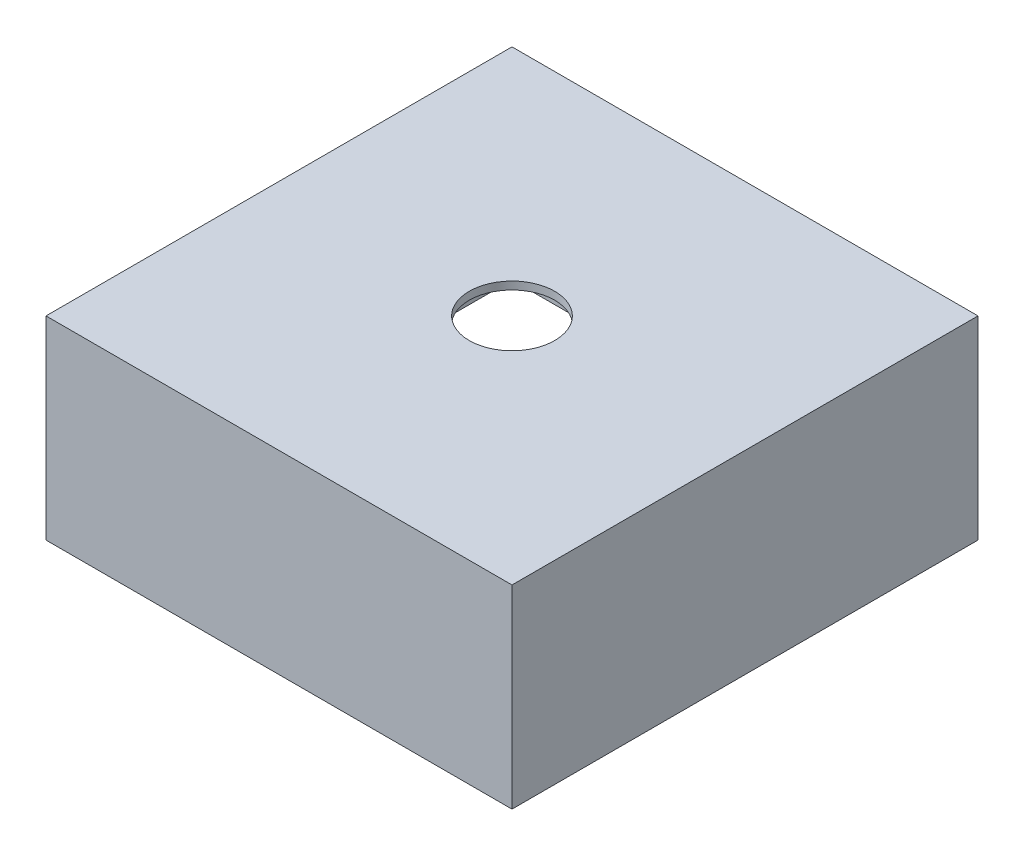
from build123d import *

# Parameters (mm, degrees)
SKETCH1_W           = 152.4
SKETCH1_H           = 152.4
BOSS_EXTRUDE1_DEPTH = 63.5
SHELL1_T            = -2.54
SKETCH2_R           = 13.97
CUT_EXTRUDE1_DEPTH  = 2.54


with BuildPart() as part:
    # Sketch1 → Boss-Extrude1 (new body)
    with BuildSketch(Plane(origin=(0, 0, 0), x_dir=(1, 0, 0), z_dir=(0, 1, 0))):
        Rectangle(SKETCH1_W, SKETCH1_H)
    extrude(amount=BOSS_EXTRUDE1_DEPTH)

    # Shell1
    shell1_openings = [part.faces().sort_by_distance(p)[0] for p in [
        (0, 0, 0),
    ]]
    offset(amount=SHELL1_T, openings=shell1_openings, kind=Kind.INTERSECTION)

    # Sketch2 → Cut-Extrude1 (cut)
    with BuildSketch(Plane(origin=(0, 63.5, 0), x_dir=(1, 0, 0), z_dir=(0, 1, 0))):
        with Locations(Location((0, 0, 0), (0, 0, 270))):
            Circle(SKETCH2_R)
    extrude(amount=-CUT_EXTRUDE1_DEPTH, mode=Mode.SUBTRACT)


solid = part.part
